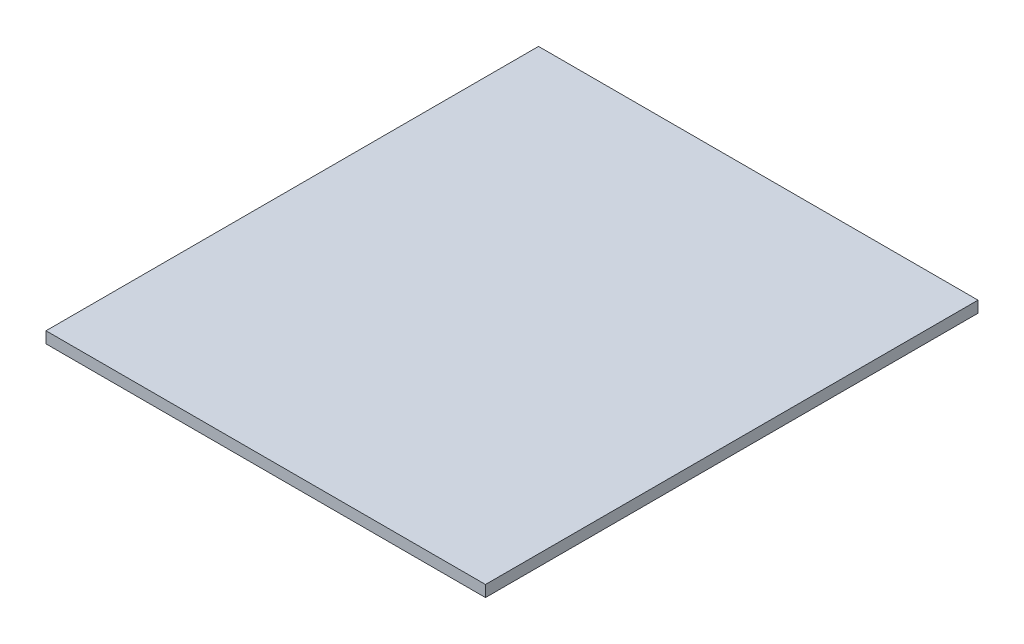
from build123d import *

# Parameters (mm, degrees)
ESQUISSE1_W          = 116
ESQUISSE1_H          = 3
BASE_EXTRUSION_DEPTH = 130


with BuildPart() as part:
    # Esquisse1 → Base-Extrusion (new body)
    with BuildSketch(Plane.XY):
        with Locations((-7.63510453, -4.141986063)):
            Rectangle(ESQUISSE1_W, ESQUISSE1_H)
    extrude(amount=BASE_EXTRUSION_DEPTH)


solid = part.part
